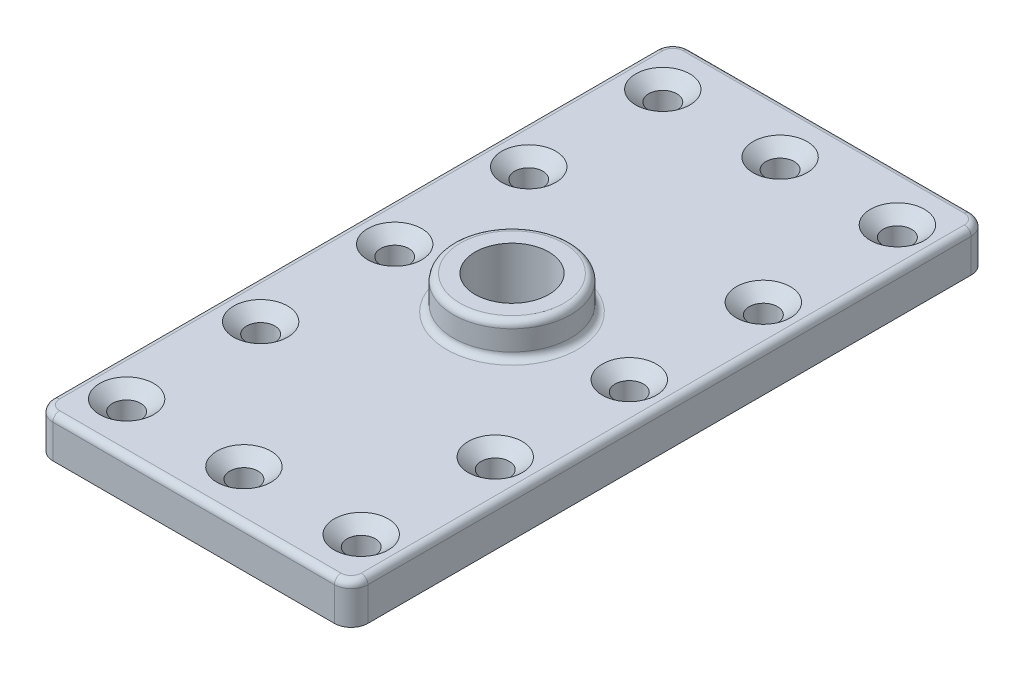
from build123d import *

# Parameters (mm, degrees)
SKETCH1_W                                           = 94
SKETCH1_H                                           = 190
PLATE_DEPTH                                         = 12
SKETCH2_R                                           = 17.5
BOSS_DEPTH                                          = 10
SKETCH3_R                                           = 11
CENTER_HOLE_DEPTH                                   = 109.249711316
CSK_FOR_5_16_FLAT_HEAD_MACHINE_SCREW_10_D           = 8.4328
CSK_FOR_5_16_FLAT_HEAD_MACHINE_SCREW_10_CSINK_D     = 16.129
CSK_FOR_5_16_FLAT_HEAD_MACHINE_SCREW_10_CSINK_ANGLE = 100
FILLET_R5_R                                         = 5
FILLET_R2_R                                         = 2
LINEARPATTERN_COUNT                                 = 5
LINEARPATTERN_PITCH                                 = 40
LINEARPATTERN_COUNT_DIR2                            = 3
LINEARPATTERN_PITCH_DIR2                            = 35


with BuildPart() as part:
    # Sketch1 → plate (new body)
    with BuildSketch(Plane(origin=(0, 0, 0), x_dir=(1, 0, 0), z_dir=(0, 1, 0))):
        Rectangle(SKETCH1_W, SKETCH1_H)
    extrude(amount=PLATE_DEPTH)

    # Sketch2 → boss (add)
    with BuildSketch(Plane(origin=(0, 12, 0), x_dir=(-1, 0, 0), z_dir=(0, 1, 0))):
        with Locations(Location((0, 0, 0), (0, 0, 270))):
            Circle(SKETCH2_R)
    extrude(amount=BOSS_DEPTH)

    # Sketch3 → center hole (cut, through all)
    with BuildSketch(Plane(origin=(0, 22, 0), x_dir=(-1, 0, 0), z_dir=(0, 1, 0))):
        with Locations(Location((0, 0, 0), (0, 0, 90))):
            Circle(SKETCH3_R)
    extrude(amount=-CENTER_HOLE_DEPTH, mode=Mode.SUBTRACT)

    # CSK for 5_16 Flat Head Machine Screw _10 (through all)
    with Locations(Plane(origin=(0, 12, 0), x_dir=(-1, 0, 0), z_dir=(0, 1, 0))):
        with Locations((35, 80)):
            csk_for_5_16_flat_head_machine_screw_10 = CounterSinkHole(CSK_FOR_5_16_FLAT_HEAD_MACHINE_SCREW_10_D / 2, CSK_FOR_5_16_FLAT_HEAD_MACHINE_SCREW_10_CSINK_D / 2, counter_sink_angle=CSK_FOR_5_16_FLAT_HEAD_MACHINE_SCREW_10_CSINK_ANGLE)

    # Fillet R5
    fillet_r5_edges = [part.edges().sort_by_distance(p)[0] for p in [
        (-47, 6, -95),
        (47, 6, -95),
        (47, 6, 95),
        (-47, 6, 95),
    ]]
    fillet(fillet_r5_edges, radius=FILLET_R5_R)

    # Fillet R2
    fillet_r2_edges = [part.edges().sort_by_distance(p)[0] for p in [
        (0, 12, 17.5),
        (0, 22, 17.5),
        (47, 12, 0),
        (0, 12, 95),
        (-47, 12, 0),
        (0, 12, -95),
        (45.535533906, 12, -93.535533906),
        (-45.535533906, 12, -93.535533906),
        (-45.535533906, 12, 93.535533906),
        (45.535533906, 12, 93.535533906),
    ]]
    fillet(fillet_r2_edges, radius=FILLET_R2_R)

    # LinearPattern: CSK for 5_16 Flat Head Machine Screw _10 5 × 3, 3 skipped
    with Locations(*[(j * LINEARPATTERN_PITCH_DIR2, 0, -i * LINEARPATTERN_PITCH) for i in range(LINEARPATTERN_COUNT) for j in range(LINEARPATTERN_COUNT_DIR2) if (i, j) not in ((0, 0), (1, 1), (2, 1), (3, 1))]):
        add(csk_for_5_16_flat_head_machine_screw_10, mode=Mode.SUBTRACT)


solid = part.part
